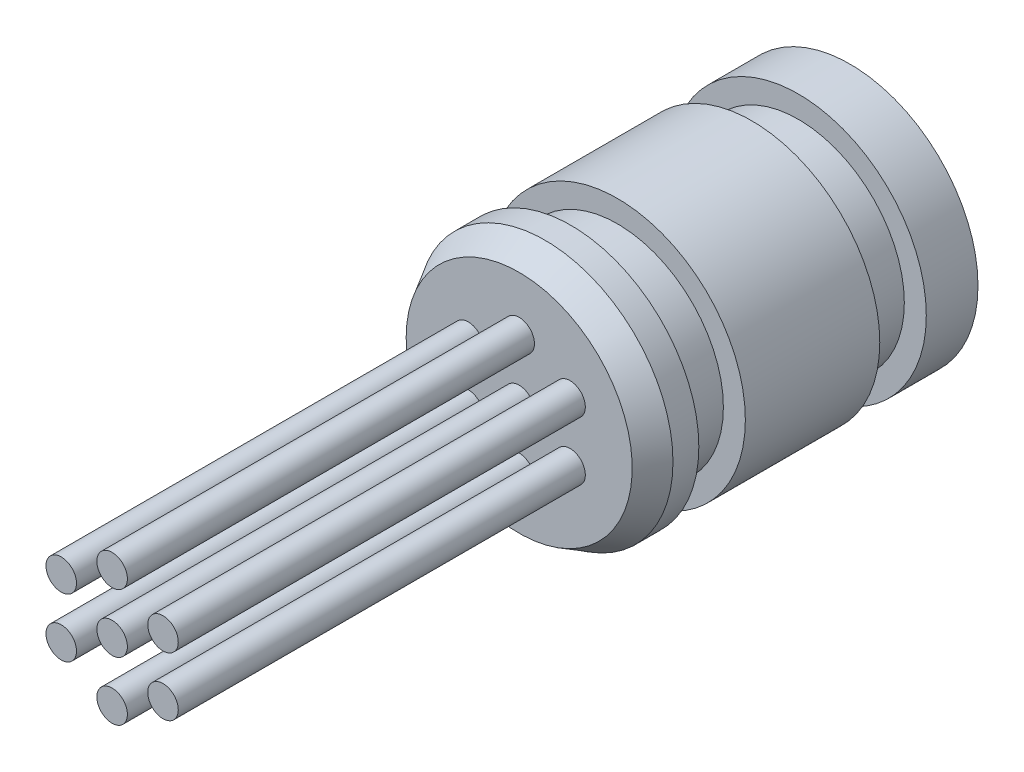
ISO-10303-21;
HEADER;
FILE_DESCRIPTION(('STEP AP214'),'2;1');
FILE_NAME('part.step','',(''),(''),'','','');
FILE_SCHEMA(('AUTOMOTIVE_DESIGN { 1 0 10303 214 1 1 1 1 }'));
ENDSEC;
DATA;
#1=APPLICATION_CONTEXT('core data for automotive mechanical design processes');
#2=APPLICATION_PROTOCOL_DEFINITION('international standard','automotive_design',2000,#1);
#3=PRODUCT_CONTEXT('',#1,'mechanical');
#4=PRODUCT('Part','Part','',(#3));
#5=PRODUCT_RELATED_PRODUCT_CATEGORY('part','',(#4));
#6=PRODUCT_DEFINITION_FORMATION('','',#4);
#7=PRODUCT_DEFINITION_CONTEXT('part definition',#1,'design');
#8=PRODUCT_DEFINITION('design','',#6,#7);
#9=PRODUCT_DEFINITION_SHAPE('','',#8);
#10=(LENGTH_UNIT() NAMED_UNIT(*) SI_UNIT(.MILLI.,.METRE.));
#11=(NAMED_UNIT(*) PLANE_ANGLE_UNIT() SI_UNIT($,.RADIAN.));
#12=(NAMED_UNIT(*) SI_UNIT($,.STERADIAN.) SOLID_ANGLE_UNIT());
#13=UNCERTAINTY_MEASURE_WITH_UNIT(LENGTH_MEASURE(1.E-05),#10,'distance_accuracy_value','');
#14=(GEOMETRIC_REPRESENTATION_CONTEXT(3) GLOBAL_UNCERTAINTY_ASSIGNED_CONTEXT((#13)) GLOBAL_UNIT_ASSIGNED_CONTEXT((#10,
#11,#12)) REPRESENTATION_CONTEXT('',''));
#15=CARTESIAN_POINT('',(0.,0.,0.));
#16=DIRECTION('',(0.,0.,1.));
#17=DIRECTION('',(1.,0.,0.));
#18=AXIS2_PLACEMENT_3D('',#15,#16,#17);
#19=CARTESIAN_POINT('',(0.,0.,16.256));
#20=DIRECTION('',(0.,0.,1.));
#21=DIRECTION('',(1.,0.,0.));
#22=AXIS2_PLACEMENT_3D('',#19,#20,#21);
#23=PLANE('',#22);
#24=CARTESIAN_POINT('',(-2.5,1.44337567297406,16.256));
#25=DIRECTION('',(0.,0.,1.));
#26=DIRECTION('',(1.,0.,0.));
#27=AXIS2_PLACEMENT_3D('',#24,#25,#26);
#28=CIRCLE('',#27,0.75);
#29=CARTESIAN_POINT('',(-1.75,1.44337567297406,16.256));
#30=VERTEX_POINT('',#29);
#31=EDGE_CURVE('E133',#30,#30,#28,.T.);
#32=ORIENTED_EDGE('',*,*,#31,.F.);
#33=EDGE_LOOP('',(#32));
#34=FACE_BOUND('',#33,.T.);
#35=CARTESIAN_POINT('',(-2.5,-1.44337567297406,16.256));
#36=DIRECTION('',(0.,0.,1.));
#37=DIRECTION('',(1.,0.,0.));
#38=AXIS2_PLACEMENT_3D('',#35,#36,#37);
#39=CIRCLE('',#38,0.75);
#40=CARTESIAN_POINT('',(-1.75,-1.44337567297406,16.256));
#41=VERTEX_POINT('',#40);
#42=EDGE_CURVE('E127',#41,#41,#39,.T.);
#43=ORIENTED_EDGE('',*,*,#42,.F.);
#44=EDGE_LOOP('',(#43));
#45=FACE_BOUND('',#44,.T.);
#46=CARTESIAN_POINT('',(0.,-2.88675134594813,16.256));
#47=DIRECTION('',(0.,0.,1.));
#48=DIRECTION('',(1.,0.,0.));
#49=AXIS2_PLACEMENT_3D('',#46,#47,#48);
#50=CIRCLE('',#49,0.75);
#51=CARTESIAN_POINT('',(0.75,-2.88675134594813,16.256));
#52=VERTEX_POINT('',#51);
#53=EDGE_CURVE('E121',#52,#52,#50,.T.);
#54=ORIENTED_EDGE('',*,*,#53,.F.);
#55=EDGE_LOOP('',(#54));
#56=FACE_BOUND('',#55,.T.);
#57=CARTESIAN_POINT('',(2.5,-1.44337567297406,16.256));
#58=DIRECTION('',(0.,0.,1.));
#59=DIRECTION('',(1.,0.,0.));
#60=AXIS2_PLACEMENT_3D('',#57,#58,#59);
#61=CIRCLE('',#60,0.75);
#62=CARTESIAN_POINT('',(3.25,-1.44337567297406,16.256));
#63=VERTEX_POINT('',#62);
#64=EDGE_CURVE('E115',#63,#63,#61,.T.);
#65=ORIENTED_EDGE('',*,*,#64,.F.);
#66=EDGE_LOOP('',(#65));
#67=FACE_BOUND('',#66,.T.);
#68=CARTESIAN_POINT('',(2.5,1.44337567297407,16.256));
#69=DIRECTION('',(0.,0.,1.));
#70=DIRECTION('',(1.,0.,0.));
#71=AXIS2_PLACEMENT_3D('',#68,#69,#70);
#72=CIRCLE('',#71,0.75);
#73=CARTESIAN_POINT('',(3.25,1.44337567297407,16.256));
#74=VERTEX_POINT('',#73);
#75=EDGE_CURVE('E109',#74,#74,#72,.T.);
#76=ORIENTED_EDGE('',*,*,#75,.F.);
#77=EDGE_LOOP('',(#76));
#78=FACE_BOUND('',#77,.T.);
#79=CARTESIAN_POINT('',(0.,2.88675134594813,16.256));
#80=DIRECTION('',(0.,0.,1.));
#81=DIRECTION('',(1.,0.,0.));
#82=AXIS2_PLACEMENT_3D('',#79,#80,#81);
#83=CIRCLE('',#82,0.75);
#84=CARTESIAN_POINT('',(0.75,2.88675134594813,16.256));
#85=VERTEX_POINT('',#84);
#86=EDGE_CURVE('E103',#85,#85,#83,.T.);
#87=ORIENTED_EDGE('',*,*,#86,.F.);
#88=EDGE_LOOP('',(#87));
#89=FACE_BOUND('',#88,.T.);
#90=CARTESIAN_POINT('',(0.,0.,16.256));
#91=DIRECTION('',(0.,0.,1.));
#92=DIRECTION('',(1.,0.,0.));
#93=AXIS2_PLACEMENT_3D('',#90,#91,#92);
#94=CIRCLE('',#93,0.75);
#95=CARTESIAN_POINT('',(0.75,0.,16.256));
#96=VERTEX_POINT('',#95);
#97=EDGE_CURVE('E96',#96,#96,#94,.T.);
#98=ORIENTED_EDGE('',*,*,#97,.F.);
#99=EDGE_LOOP('',(#98));
#100=FACE_BOUND('',#99,.T.);
#101=CARTESIAN_POINT('',(0.,0.,16.2559999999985));
#102=DIRECTION('',(0.,0.,-1.));
#103=DIRECTION('',(-1.,0.,0.));
#104=AXIS2_PLACEMENT_3D('',#101,#102,#103);
#105=CIRCLE('',#104,5.55326515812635);
#106=CARTESIAN_POINT('',(-5.55326515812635,0.,16.2559999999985));
#107=VERTEX_POINT('',#106);
#108=EDGE_CURVE('E42',#107,#107,#105,.T.);
#109=ORIENTED_EDGE('',*,*,#108,.F.);
#110=EDGE_LOOP('',(#109));
#111=FACE_BOUND('',#110,.T.);
#112=ADVANCED_FACE('F39',(#34,#45,#56,#67,#78,#89,#100,#111),#23,.T.);
#113=CARTESIAN_POINT('',(0.,0.,14.9860000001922));
#114=DIRECTION('',(0.,0.,-1.));
#115=DIRECTION('',(-1.,0.,0.));
#116=AXIS2_PLACEMENT_3D('',#113,#114,#115);
#117=CONICAL_SURFACE('',#116,6.28649999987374,0.523598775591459);
#118=ORIENTED_EDGE('',*,*,#108,.T.);
#119=EDGE_LOOP('',(#118));
#120=FACE_BOUND('',#119,.T.);
#121=CARTESIAN_POINT('',(0.,0.,14.986));
#122=DIRECTION('',(0.,0.,-1.));
#123=DIRECTION('',(-1.,0.,0.));
#124=AXIS2_PLACEMENT_3D('',#121,#122,#123);
#125=CIRCLE('',#124,6.2865);
#126=CARTESIAN_POINT('',(-6.2865,0.,14.986));
#127=VERTEX_POINT('',#126);
#128=EDGE_CURVE('E57',#127,#127,#125,.T.);
#129=ORIENTED_EDGE('',*,*,#128,.F.);
#130=EDGE_LOOP('',(#129));
#131=FACE_BOUND('',#130,.T.);
#132=ADVANCED_FACE('F150',(#120,#131),#117,.T.);
#133=CARTESIAN_POINT('',(0.,0.,0.));
#134=DIRECTION('',(0.,0.,1.));
#135=DIRECTION('',(1.,0.,0.));
#136=AXIS2_PLACEMENT_3D('',#133,#134,#135);
#137=PLANE('',#136);
#138=CARTESIAN_POINT('',(0.,0.,0.));
#139=DIRECTION('',(0.,0.,-1.));
#140=DIRECTION('',(-1.,0.,0.));
#141=AXIS2_PLACEMENT_3D('',#138,#139,#140);
#142=CIRCLE('',#141,6.2865);
#143=CARTESIAN_POINT('',(-6.2865,0.,0.));
#144=VERTEX_POINT('',#143);
#145=EDGE_CURVE('E81',#144,#144,#142,.F.);
#146=ORIENTED_EDGE('',*,*,#145,.F.);
#147=EDGE_LOOP('',(#146));
#148=FACE_BOUND('',#147,.T.);
#149=ADVANCED_FACE('F209',(#148),#137,.F.);
#150=CARTESIAN_POINT('',(0.,0.,16.256));
#151=DIRECTION('',(0.,0.,-1.));
#152=DIRECTION('',(-1.,0.,0.));
#153=AXIS2_PLACEMENT_3D('',#150,#151,#152);
#154=CYLINDRICAL_SURFACE('',#153,6.2865);
#155=ORIENTED_EDGE('',*,*,#128,.T.);
#156=EDGE_LOOP('',(#155));
#157=FACE_BOUND('',#156,.T.);
#158=CARTESIAN_POINT('',(0.,0.,13.716));
#159=DIRECTION('',(0.,0.,-1.));
#160=DIRECTION('',(-1.,0.,0.));
#161=AXIS2_PLACEMENT_3D('',#158,#159,#160);
#162=CIRCLE('',#161,6.2865);
#163=CARTESIAN_POINT('',(-6.2865,0.,13.716));
#164=VERTEX_POINT('',#163);
#165=EDGE_CURVE('E78',#164,#164,#162,.F.);
#166=ORIENTED_EDGE('',*,*,#165,.T.);
#167=EDGE_LOOP('',(#166));
#168=FACE_BOUND('',#167,.T.);
#169=ADVANCED_FACE('F206',(#157,#168),#154,.T.);
#170=CARTESIAN_POINT('',(0.,0.,16.256));
#171=DIRECTION('',(0.,0.,-1.));
#172=DIRECTION('',(-1.,0.,0.));
#173=AXIS2_PLACEMENT_3D('',#170,#171,#172);
#174=CYLINDRICAL_SURFACE('',#173,6.2865);
#175=ORIENTED_EDGE('',*,*,#145,.T.);
#176=EDGE_LOOP('',(#175));
#177=FACE_BOUND('',#176,.T.);
#178=CARTESIAN_POINT('',(0.,0.,2.54));
#179=DIRECTION('',(0.,0.,-1.));
#180=DIRECTION('',(-1.,0.,0.));
#181=AXIS2_PLACEMENT_3D('',#178,#179,#180);
#182=CIRCLE('',#181,6.2865);
#183=CARTESIAN_POINT('',(-6.2865,0.,2.54));
#184=VERTEX_POINT('',#183);
#185=EDGE_CURVE('E74',#184,#184,#182,.F.);
#186=ORIENTED_EDGE('',*,*,#185,.F.);
#187=EDGE_LOOP('',(#186));
#188=FACE_BOUND('',#187,.T.);
#189=ADVANCED_FACE('F202',(#177,#188),#174,.T.);
#190=CARTESIAN_POINT('',(0.,0.,13.716));
#191=DIRECTION('',(0.,0.,1.));
#192=DIRECTION('',(1.,0.,0.));
#193=AXIS2_PLACEMENT_3D('',#190,#191,#192);
#194=PLANE('',#193);
#195=ORIENTED_EDGE('',*,*,#165,.F.);
#196=EDGE_LOOP('',(#195));
#197=FACE_BOUND('',#196,.T.);
#198=CARTESIAN_POINT('',(0.,0.,13.716));
#199=DIRECTION('',(0.,0.,1.));
#200=DIRECTION('',(1.,0.,0.));
#201=AXIS2_PLACEMENT_3D('',#198,#199,#200);
#202=CIRCLE('',#201,5.207);
#203=CARTESIAN_POINT('',(5.207,0.,13.716));
#204=VERTEX_POINT('',#203);
#205=EDGE_CURVE('E70',#204,#204,#202,.F.);
#206=ORIENTED_EDGE('',*,*,#205,.F.);
#207=EDGE_LOOP('',(#206));
#208=FACE_BOUND('',#207,.T.);
#209=ADVANCED_FACE('F198',(#197,#208),#194,.F.);
#210=CARTESIAN_POINT('',(0.,0.,2.54));
#211=DIRECTION('',(0.,0.,1.));
#212=DIRECTION('',(1.,0.,0.));
#213=AXIS2_PLACEMENT_3D('',#210,#211,#212);
#214=PLANE('',#213);
#215=ORIENTED_EDGE('',*,*,#185,.T.);
#216=EDGE_LOOP('',(#215));
#217=FACE_BOUND('',#216,.T.);
#218=CARTESIAN_POINT('',(0.,0.,2.54));
#219=DIRECTION('',(0.,0.,1.));
#220=DIRECTION('',(1.,0.,0.));
#221=AXIS2_PLACEMENT_3D('',#218,#219,#220);
#222=CIRCLE('',#221,5.207);
#223=CARTESIAN_POINT('',(5.207,0.,2.54));
#224=VERTEX_POINT('',#223);
#225=EDGE_CURVE('E67',#224,#224,#222,.T.);
#226=ORIENTED_EDGE('',*,*,#225,.F.);
#227=EDGE_LOOP('',(#226));
#228=FACE_BOUND('',#227,.T.);
#229=ADVANCED_FACE('F194',(#217,#228),#214,.T.);
#230=CARTESIAN_POINT('',(0.,0.,11.43));
#231=DIRECTION('',(0.,0.,1.));
#232=DIRECTION('',(1.,0.,0.));
#233=AXIS2_PLACEMENT_3D('',#230,#231,#232);
#234=CYLINDRICAL_SURFACE('',#233,5.207);
#235=CARTESIAN_POINT('',(0.,0.,11.43));
#236=DIRECTION('',(0.,0.,1.));
#237=DIRECTION('',(1.,0.,0.));
#238=AXIS2_PLACEMENT_3D('',#235,#236,#237);
#239=CIRCLE('',#238,5.207);
#240=CARTESIAN_POINT('',(5.207,0.,11.43));
#241=VERTEX_POINT('',#240);
#242=EDGE_CURVE('E63',#241,#241,#239,.F.);
#243=ORIENTED_EDGE('',*,*,#242,.F.);
#244=EDGE_LOOP('',(#243));
#245=FACE_BOUND('',#244,.T.);
#246=ORIENTED_EDGE('',*,*,#205,.T.);
#247=EDGE_LOOP('',(#246));
#248=FACE_BOUND('',#247,.T.);
#249=ADVANCED_FACE('F190',(#245,#248),#234,.T.);
#250=CARTESIAN_POINT('',(0.,0.,2.54));
#251=DIRECTION('',(0.,0.,1.));
#252=DIRECTION('',(1.,0.,0.));
#253=AXIS2_PLACEMENT_3D('',#250,#251,#252);
#254=CYLINDRICAL_SURFACE('',#253,5.207);
#255=CARTESIAN_POINT('',(0.,0.,4.826));
#256=DIRECTION('',(0.,0.,1.));
#257=DIRECTION('',(1.,0.,0.));
#258=AXIS2_PLACEMENT_3D('',#255,#256,#257);
#259=CIRCLE('',#258,5.207);
#260=CARTESIAN_POINT('',(5.207,0.,4.826));
#261=VERTEX_POINT('',#260);
#262=EDGE_CURVE('E54',#261,#261,#259,.F.);
#263=ORIENTED_EDGE('',*,*,#262,.T.);
#264=EDGE_LOOP('',(#263));
#265=FACE_BOUND('',#264,.T.);
#266=ORIENTED_EDGE('',*,*,#225,.T.);
#267=EDGE_LOOP('',(#266));
#268=FACE_BOUND('',#267,.T.);
#269=ADVANCED_FACE('F186',(#265,#268),#254,.T.);
#270=CARTESIAN_POINT('',(0.,0.,11.43));
#271=DIRECTION('',(0.,0.,1.));
#272=DIRECTION('',(1.,0.,0.));
#273=AXIS2_PLACEMENT_3D('',#270,#271,#272);
#274=PLANE('',#273);
#275=CARTESIAN_POINT('',(0.,0.,11.43));
#276=DIRECTION('',(0.,0.,-1.));
#277=DIRECTION('',(-1.,0.,0.));
#278=AXIS2_PLACEMENT_3D('',#275,#276,#277);
#279=CIRCLE('',#278,6.2865);
#280=CARTESIAN_POINT('',(-6.2865,0.,11.43));
#281=VERTEX_POINT('',#280);
#282=EDGE_CURVE('E47',#281,#281,#279,.T.);
#283=ORIENTED_EDGE('',*,*,#282,.F.);
#284=EDGE_LOOP('',(#283));
#285=FACE_BOUND('',#284,.T.);
#286=ORIENTED_EDGE('',*,*,#242,.T.);
#287=EDGE_LOOP('',(#286));
#288=FACE_BOUND('',#287,.T.);
#289=ADVANCED_FACE('F182',(#285,#288),#274,.T.);
#290=CARTESIAN_POINT('',(0.,0.,4.826));
#291=DIRECTION('',(0.,0.,1.));
#292=DIRECTION('',(1.,0.,0.));
#293=AXIS2_PLACEMENT_3D('',#290,#291,#292);
#294=PLANE('',#293);
#295=CARTESIAN_POINT('',(0.,0.,4.826));
#296=DIRECTION('',(0.,0.,-1.));
#297=DIRECTION('',(-1.,0.,0.));
#298=AXIS2_PLACEMENT_3D('',#295,#296,#297);
#299=CIRCLE('',#298,6.2865);
#300=CARTESIAN_POINT('',(-6.2865,0.,4.826));
#301=VERTEX_POINT('',#300);
#302=EDGE_CURVE('E10',#301,#301,#299,.F.);
#303=ORIENTED_EDGE('',*,*,#302,.F.);
#304=EDGE_LOOP('',(#303));
#305=FACE_BOUND('',#304,.T.);
#306=ORIENTED_EDGE('',*,*,#262,.F.);
#307=EDGE_LOOP('',(#306));
#308=FACE_BOUND('',#307,.T.);
#309=ADVANCED_FACE('F176',(#305,#308),#294,.F.);
#310=CARTESIAN_POINT('',(0.,0.,16.256));
#311=DIRECTION('',(0.,0.,-1.));
#312=DIRECTION('',(-1.,0.,0.));
#313=AXIS2_PLACEMENT_3D('',#310,#311,#312);
#314=CYLINDRICAL_SURFACE('',#313,6.2865);
#315=ORIENTED_EDGE('',*,*,#302,.T.);
#316=EDGE_LOOP('',(#315));
#317=FACE_BOUND('',#316,.T.);
#318=ORIENTED_EDGE('',*,*,#282,.T.);
#319=EDGE_LOOP('',(#318));
#320=FACE_BOUND('',#319,.T.);
#321=ADVANCED_FACE('F167',(#317,#320),#314,.T.);
#322=CARTESIAN_POINT('',(0.,0.,36.256));
#323=DIRECTION('',(0.,0.,-1.));
#324=DIRECTION('',(-1.,0.,0.));
#325=AXIS2_PLACEMENT_3D('',#322,#323,#324);
#326=CYLINDRICAL_SURFACE('',#325,0.75);
#327=CARTESIAN_POINT('',(0.,0.,36.256));
#328=DIRECTION('',(0.,0.,1.));
#329=DIRECTION('',(1.,0.,0.));
#330=AXIS2_PLACEMENT_3D('',#327,#328,#329);
#331=CIRCLE('',#330,0.75);
#332=CARTESIAN_POINT('',(0.75,0.,36.256));
#333=VERTEX_POINT('',#332);
#334=EDGE_CURVE('E92',#333,#333,#331,.T.);
#335=ORIENTED_EDGE('',*,*,#334,.F.);
#336=EDGE_LOOP('',(#335));
#337=FACE_BOUND('',#336,.T.);
#338=ORIENTED_EDGE('',*,*,#97,.T.);
#339=EDGE_LOOP('',(#338));
#340=FACE_BOUND('',#339,.T.);
#341=ADVANCED_FACE('F151',(#337,#340),#326,.T.);
#342=CARTESIAN_POINT('',(0.,0.,36.256));
#343=DIRECTION('',(0.,0.,1.));
#344=DIRECTION('',(1.,0.,0.));
#345=AXIS2_PLACEMENT_3D('',#342,#343,#344);
#346=PLANE('',#345);
#347=ORIENTED_EDGE('',*,*,#334,.T.);
#348=EDGE_LOOP('',(#347));
#349=FACE_BOUND('',#348,.T.);
#350=ADVANCED_FACE('F166',(#349),#346,.T.);
#351=CARTESIAN_POINT('',(0.,2.88675134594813,36.256));
#352=DIRECTION('',(0.,0.,-1.));
#353=DIRECTION('',(-1.,0.,0.));
#354=AXIS2_PLACEMENT_3D('',#351,#352,#353);
#355=CYLINDRICAL_SURFACE('',#354,0.75);
#356=CARTESIAN_POINT('',(0.,2.88675134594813,36.256));
#357=DIRECTION('',(0.,0.,1.));
#358=DIRECTION('',(1.,0.,0.));
#359=AXIS2_PLACEMENT_3D('',#356,#357,#358);
#360=CIRCLE('',#359,0.75);
#361=CARTESIAN_POINT('',(0.75,2.88675134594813,36.256));
#362=VERTEX_POINT('',#361);
#363=EDGE_CURVE('E101',#362,#362,#360,.T.);
#364=ORIENTED_EDGE('',*,*,#363,.F.);
#365=EDGE_LOOP('',(#364));
#366=FACE_BOUND('',#365,.T.);
#367=ORIENTED_EDGE('',*,*,#86,.T.);
#368=EDGE_LOOP('',(#367));
#369=FACE_BOUND('',#368,.T.);
#370=ADVANCED_FACE('F174',(#366,#369),#355,.T.);
#371=CARTESIAN_POINT('',(0.,2.88675134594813,36.256));
#372=DIRECTION('',(0.,0.,1.));
#373=DIRECTION('',(1.,0.,0.));
#374=AXIS2_PLACEMENT_3D('',#371,#372,#373);
#375=PLANE('',#374);
#376=ORIENTED_EDGE('',*,*,#363,.T.);
#377=EDGE_LOOP('',(#376));
#378=FACE_BOUND('',#377,.T.);
#379=ADVANCED_FACE('F313',(#378),#375,.T.);
#380=CARTESIAN_POINT('',(2.5,1.44337567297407,36.256));
#381=DIRECTION('',(0.,0.,-1.));
#382=DIRECTION('',(-1.,0.,0.));
#383=AXIS2_PLACEMENT_3D('',#380,#381,#382);
#384=CYLINDRICAL_SURFACE('',#383,0.75);
#385=CARTESIAN_POINT('',(2.5,1.44337567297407,36.256));
#386=DIRECTION('',(0.,0.,1.));
#387=DIRECTION('',(1.,0.,0.));
#388=AXIS2_PLACEMENT_3D('',#385,#386,#387);
#389=CIRCLE('',#388,0.75);
#390=CARTESIAN_POINT('',(3.25,1.44337567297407,36.256));
#391=VERTEX_POINT('',#390);
#392=EDGE_CURVE('E106',#391,#391,#389,.T.);
#393=ORIENTED_EDGE('',*,*,#392,.F.);
#394=EDGE_LOOP('',(#393));
#395=FACE_BOUND('',#394,.T.);
#396=ORIENTED_EDGE('',*,*,#75,.T.);
#397=EDGE_LOOP('',(#396));
#398=FACE_BOUND('',#397,.T.);
#399=ADVANCED_FACE('F322',(#395,#398),#384,.T.);
#400=CARTESIAN_POINT('',(2.5,1.44337567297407,36.256));
#401=DIRECTION('',(0.,0.,1.));
#402=DIRECTION('',(1.,0.,0.));
#403=AXIS2_PLACEMENT_3D('',#400,#401,#402);
#404=PLANE('',#403);
#405=ORIENTED_EDGE('',*,*,#392,.T.);
#406=EDGE_LOOP('',(#405));
#407=FACE_BOUND('',#406,.T.);
#408=ADVANCED_FACE('F332',(#407),#404,.T.);
#409=CARTESIAN_POINT('',(2.5,-1.44337567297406,36.256));
#410=DIRECTION('',(0.,0.,-1.));
#411=DIRECTION('',(-1.,0.,0.));
#412=AXIS2_PLACEMENT_3D('',#409,#410,#411);
#413=CYLINDRICAL_SURFACE('',#412,0.75);
#414=CARTESIAN_POINT('',(2.5,-1.44337567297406,36.256));
#415=DIRECTION('',(0.,0.,1.));
#416=DIRECTION('',(1.,0.,0.));
#417=AXIS2_PLACEMENT_3D('',#414,#415,#416);
#418=CIRCLE('',#417,0.75);
#419=CARTESIAN_POINT('',(3.25,-1.44337567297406,36.256));
#420=VERTEX_POINT('',#419);
#421=EDGE_CURVE('E112',#420,#420,#418,.T.);
#422=ORIENTED_EDGE('',*,*,#421,.F.);
#423=EDGE_LOOP('',(#422));
#424=FACE_BOUND('',#423,.T.);
#425=ORIENTED_EDGE('',*,*,#64,.T.);
#426=EDGE_LOOP('',(#425));
#427=FACE_BOUND('',#426,.T.);
#428=ADVANCED_FACE('F342',(#424,#427),#413,.T.);
#429=CARTESIAN_POINT('',(2.5,-1.44337567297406,36.256));
#430=DIRECTION('',(0.,0.,1.));
#431=DIRECTION('',(1.,0.,0.));
#432=AXIS2_PLACEMENT_3D('',#429,#430,#431);
#433=PLANE('',#432);
#434=ORIENTED_EDGE('',*,*,#421,.T.);
#435=EDGE_LOOP('',(#434));
#436=FACE_BOUND('',#435,.T.);
#437=ADVANCED_FACE('F352',(#436),#433,.T.);
#438=CARTESIAN_POINT('',(0.,-2.88675134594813,36.256));
#439=DIRECTION('',(0.,0.,-1.));
#440=DIRECTION('',(-1.,0.,0.));
#441=AXIS2_PLACEMENT_3D('',#438,#439,#440);
#442=CYLINDRICAL_SURFACE('',#441,0.75);
#443=CARTESIAN_POINT('',(0.,-2.88675134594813,36.256));
#444=DIRECTION('',(0.,0.,1.));
#445=DIRECTION('',(1.,0.,0.));
#446=AXIS2_PLACEMENT_3D('',#443,#444,#445);
#447=CIRCLE('',#446,0.75);
#448=CARTESIAN_POINT('',(0.75,-2.88675134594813,36.256));
#449=VERTEX_POINT('',#448);
#450=EDGE_CURVE('E118',#449,#449,#447,.T.);
#451=ORIENTED_EDGE('',*,*,#450,.F.);
#452=EDGE_LOOP('',(#451));
#453=FACE_BOUND('',#452,.T.);
#454=ORIENTED_EDGE('',*,*,#53,.T.);
#455=EDGE_LOOP('',(#454));
#456=FACE_BOUND('',#455,.T.);
#457=ADVANCED_FACE('F362',(#453,#456),#442,.T.);
#458=CARTESIAN_POINT('',(0.,-2.88675134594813,36.256));
#459=DIRECTION('',(0.,0.,1.));
#460=DIRECTION('',(1.,0.,0.));
#461=AXIS2_PLACEMENT_3D('',#458,#459,#460);
#462=PLANE('',#461);
#463=ORIENTED_EDGE('',*,*,#450,.T.);
#464=EDGE_LOOP('',(#463));
#465=FACE_BOUND('',#464,.T.);
#466=ADVANCED_FACE('F372',(#465),#462,.T.);
#467=CARTESIAN_POINT('',(-2.5,-1.44337567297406,36.256));
#468=DIRECTION('',(0.,0.,-1.));
#469=DIRECTION('',(-1.,0.,0.));
#470=AXIS2_PLACEMENT_3D('',#467,#468,#469);
#471=CYLINDRICAL_SURFACE('',#470,0.75);
#472=CARTESIAN_POINT('',(-2.5,-1.44337567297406,36.256));
#473=DIRECTION('',(0.,0.,1.));
#474=DIRECTION('',(1.,0.,0.));
#475=AXIS2_PLACEMENT_3D('',#472,#473,#474);
#476=CIRCLE('',#475,0.75);
#477=CARTESIAN_POINT('',(-1.75,-1.44337567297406,36.256));
#478=VERTEX_POINT('',#477);
#479=EDGE_CURVE('E124',#478,#478,#476,.T.);
#480=ORIENTED_EDGE('',*,*,#479,.F.);
#481=EDGE_LOOP('',(#480));
#482=FACE_BOUND('',#481,.T.);
#483=ORIENTED_EDGE('',*,*,#42,.T.);
#484=EDGE_LOOP('',(#483));
#485=FACE_BOUND('',#484,.T.);
#486=ADVANCED_FACE('F382',(#482,#485),#471,.T.);
#487=CARTESIAN_POINT('',(-2.5,-1.44337567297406,36.256));
#488=DIRECTION('',(0.,0.,1.));
#489=DIRECTION('',(1.,0.,0.));
#490=AXIS2_PLACEMENT_3D('',#487,#488,#489);
#491=PLANE('',#490);
#492=ORIENTED_EDGE('',*,*,#479,.T.);
#493=EDGE_LOOP('',(#492));
#494=FACE_BOUND('',#493,.T.);
#495=ADVANCED_FACE('F144',(#494),#491,.T.);
#496=CARTESIAN_POINT('',(-2.5,1.44337567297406,36.256));
#497=DIRECTION('',(0.,0.,-1.));
#498=DIRECTION('',(-1.,0.,0.));
#499=AXIS2_PLACEMENT_3D('',#496,#497,#498);
#500=CYLINDRICAL_SURFACE('',#499,0.75);
#501=CARTESIAN_POINT('',(-2.5,1.44337567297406,36.256));
#502=DIRECTION('',(0.,0.,1.));
#503=DIRECTION('',(1.,0.,0.));
#504=AXIS2_PLACEMENT_3D('',#501,#502,#503);
#505=CIRCLE('',#504,0.75);
#506=CARTESIAN_POINT('',(-1.75,1.44337567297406,36.256));
#507=VERTEX_POINT('',#506);
#508=EDGE_CURVE('E130',#507,#507,#505,.T.);
#509=ORIENTED_EDGE('',*,*,#508,.F.);
#510=EDGE_LOOP('',(#509));
#511=FACE_BOUND('',#510,.T.);
#512=ORIENTED_EDGE('',*,*,#31,.T.);
#513=EDGE_LOOP('',(#512));
#514=FACE_BOUND('',#513,.T.);
#515=ADVANCED_FACE('F141',(#511,#514),#500,.T.);
#516=CARTESIAN_POINT('',(-2.5,1.44337567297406,36.256));
#517=DIRECTION('',(0.,0.,1.));
#518=DIRECTION('',(1.,0.,0.));
#519=AXIS2_PLACEMENT_3D('',#516,#517,#518);
#520=PLANE('',#519);
#521=ORIENTED_EDGE('',*,*,#508,.T.);
#522=EDGE_LOOP('',(#521));
#523=FACE_BOUND('',#522,.T.);
#524=ADVANCED_FACE('F139',(#523),#520,.T.);
#525=CLOSED_SHELL('',(#112,#132,#149,#169,#189,#209,#229,#249,#269,#289,#309,#321,#341,#350,
#370,#379,#399,#408,#428,#437,#457,#466,#486,#495,#515,#524));
#526=MANIFOLD_SOLID_BREP('B2',#525);
#527=ADVANCED_BREP_SHAPE_REPRESENTATION('',(#18,#526),#14);
#528=SHAPE_DEFINITION_REPRESENTATION(#9,#527);
ENDSEC;
END-ISO-10303-21;
